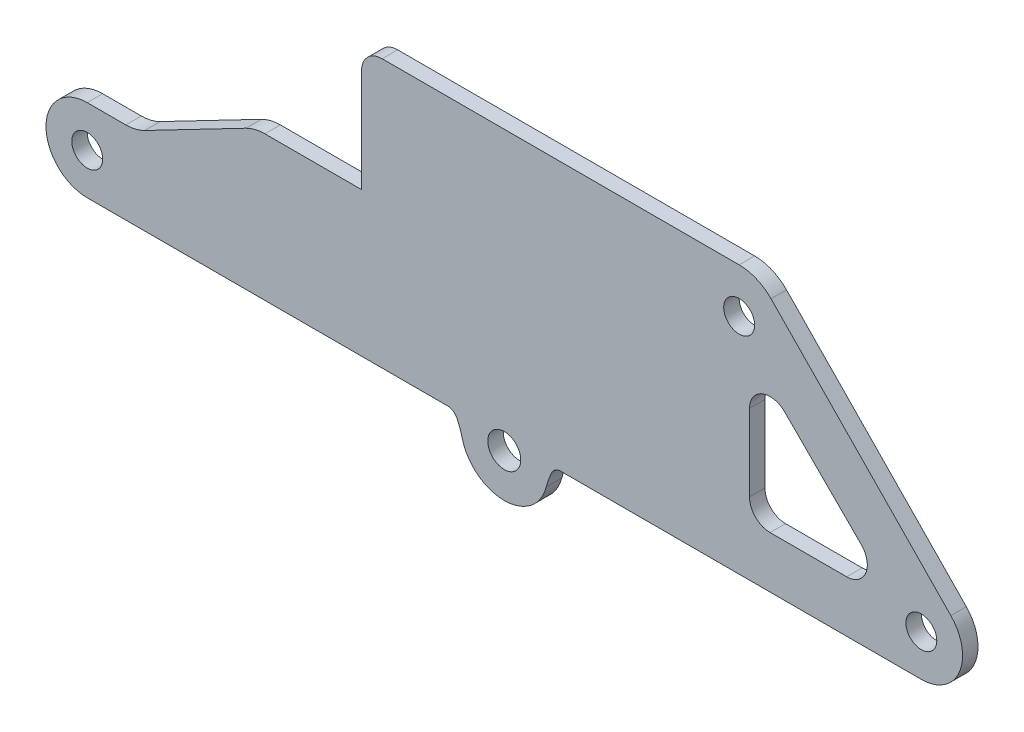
ISO-10303-21;
HEADER;
FILE_DESCRIPTION(('STEP AP214'),'2;1');
FILE_NAME('part.step','',(''),(''),'','','');
FILE_SCHEMA(('AUTOMOTIVE_DESIGN { 1 0 10303 214 1 1 1 1 }'));
ENDSEC;
DATA;
#1=APPLICATION_CONTEXT('core data for automotive mechanical design processes');
#2=APPLICATION_PROTOCOL_DEFINITION('international standard','automotive_design',2000,#1);
#3=PRODUCT_CONTEXT('',#1,'mechanical');
#4=PRODUCT('Part','Part','',(#3));
#5=PRODUCT_RELATED_PRODUCT_CATEGORY('part','',(#4));
#6=PRODUCT_DEFINITION_FORMATION('','',#4);
#7=PRODUCT_DEFINITION_CONTEXT('part definition',#1,'design');
#8=PRODUCT_DEFINITION('design','',#6,#7);
#9=PRODUCT_DEFINITION_SHAPE('','',#8);
#10=(LENGTH_UNIT() NAMED_UNIT(*) SI_UNIT(.MILLI.,.METRE.));
#11=(NAMED_UNIT(*) PLANE_ANGLE_UNIT() SI_UNIT($,.RADIAN.));
#12=(NAMED_UNIT(*) SI_UNIT($,.STERADIAN.) SOLID_ANGLE_UNIT());
#13=UNCERTAINTY_MEASURE_WITH_UNIT(LENGTH_MEASURE(1.E-05),#10,'distance_accuracy_value','');
#14=(GEOMETRIC_REPRESENTATION_CONTEXT(3) GLOBAL_UNCERTAINTY_ASSIGNED_CONTEXT((#13)) GLOBAL_UNIT_ASSIGNED_CONTEXT((#10,
#11,#12)) REPRESENTATION_CONTEXT('',''));
#15=CARTESIAN_POINT('',(0.,0.,0.));
#16=DIRECTION('',(0.,0.,1.));
#17=DIRECTION('',(1.,0.,0.));
#18=AXIS2_PLACEMENT_3D('',#15,#16,#17);
#19=CARTESIAN_POINT('',(17.,-13.,-1.5));
#20=DIRECTION('',(0.,-1.,0.));
#21=DIRECTION('',(1.,0.,0.));
#22=AXIS2_PLACEMENT_3D('',#19,#20,#21);
#23=PLANE('',#22);
#24=DIRECTION('',(1.,0.,0.));
#25=VECTOR('',#24,1.);
#26=CARTESIAN_POINT('',(17.,-13.,0.));
#27=LINE('',#26,#25);
#28=CARTESIAN_POINT('',(5.50214462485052,-13.,0.));
#29=VERTEX_POINT('',#28);
#30=CARTESIAN_POINT('',(40.4699111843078,-13.,1.56125112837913E-13));
#31=VERTEX_POINT('',#30);
#32=EDGE_CURVE('E268',#29,#31,#27,.T.);
#33=ORIENTED_EDGE('',*,*,#32,.F.);
#34=DIRECTION('',(0.,0.,1.));
#35=VECTOR('',#34,1.);
#36=CARTESIAN_POINT('',(5.50214462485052,-13.,-1.5));
#37=LINE('',#36,#35);
#38=CARTESIAN_POINT('',(5.50214462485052,-13.,-1.5));
#39=VERTEX_POINT('',#38);
#40=EDGE_CURVE('E444',#29,#39,#37,.F.);
#41=ORIENTED_EDGE('',*,*,#40,.T.);
#42=DIRECTION('',(1.,0.,0.));
#43=VECTOR('',#42,1.);
#44=CARTESIAN_POINT('',(17.,-13.,-1.5));
#45=LINE('',#44,#43);
#46=CARTESIAN_POINT('',(40.4699111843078,-13.,-1.49999999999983));
#47=VERTEX_POINT('',#46);
#48=EDGE_CURVE('E413',#39,#47,#45,.T.);
#49=ORIENTED_EDGE('',*,*,#48,.T.);
#50=DIRECTION('',(0.,0.,1.));
#51=VECTOR('',#50,1.);
#52=CARTESIAN_POINT('',(40.469911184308,-13.,-34.001));
#53=LINE('',#52,#51);
#54=EDGE_CURVE('E363',#47,#31,#53,.T.);
#55=ORIENTED_EDGE('',*,*,#54,.T.);
#56=EDGE_LOOP('',(#33,#41,#49,#55));
#57=FACE_BOUND('',#56,.T.);
#58=ADVANCED_FACE('F89',(#57),#23,.T.);
#59=CARTESIAN_POINT('',(0.,0.,-1.5));
#60=DIRECTION('',(0.,0.,1.));
#61=DIRECTION('',(1.,0.,0.));
#62=AXIS2_PLACEMENT_3D('',#59,#60,#61);
#63=PLANE('',#62);
#64=CARTESIAN_POINT('',(1.30451205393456E-12,-14.0000000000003,-1.5));
#65=DIRECTION('',(0.,0.,-1.));
#66=DIRECTION('',(-1.,0.,0.));
#67=AXIS2_PLACEMENT_3D('',#64,#65,#66);
#68=CIRCLE('',#67,1.6000000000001);
#69=CARTESIAN_POINT('',(-1.59999999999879,-14.0000000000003,-1.5));
#70=VERTEX_POINT('',#69);
#71=EDGE_CURVE('E368',#70,#70,#68,.T.);
#72=ORIENTED_EDGE('',*,*,#71,.F.);
#73=EDGE_LOOP('',(#72));
#74=FACE_BOUND('',#73,.T.);
#75=DIRECTION('',(0.,1.,0.));
#76=VECTOR('',#75,1.);
#77=CARTESIAN_POINT('',(-13.85,13.,-1.5));
#78=LINE('',#77,#76);
#79=CARTESIAN_POINT('',(-13.85,11.,-1.5));
#80=VERTEX_POINT('',#79);
#81=CARTESIAN_POINT('',(-13.85,1.00000000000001,-1.5));
#82=VERTEX_POINT('',#81);
#83=EDGE_CURVE('E405',#80,#82,#78,.F.);
#84=ORIENTED_EDGE('',*,*,#83,.F.);
#85=CARTESIAN_POINT('',(-11.85,11.,-1.5));
#86=DIRECTION('',(0.,0.,1.));
#87=DIRECTION('',(1.,0.,0.));
#88=AXIS2_PLACEMENT_3D('',#85,#86,#87);
#89=CIRCLE('',#88,2.);
#90=CARTESIAN_POINT('',(-11.85,13.,-1.5));
#91=VERTEX_POINT('',#90);
#92=EDGE_CURVE('E434',#80,#91,#89,.F.);
#93=ORIENTED_EDGE('',*,*,#92,.T.);
#94=DIRECTION('',(-1.,0.,0.));
#95=VECTOR('',#94,1.);
#96=CARTESIAN_POINT('',(17.,13.,-1.5));
#97=LINE('',#96,#95);
#98=CARTESIAN_POINT('',(22.7922416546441,13.,-1.49999999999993));
#99=VERTEX_POINT('',#98);
#100=EDGE_CURVE('E412',#99,#91,#97,.T.);
#101=ORIENTED_EDGE('',*,*,#100,.F.);
#102=CARTESIAN_POINT('',(22.7922416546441,8.67766952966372,-1.49999999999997));
#103=DIRECTION('',(0.,0.,-1.));
#104=DIRECTION('',(-1.,0.,0.));
#105=AXIS2_PLACEMENT_3D('',#102,#103,#104);
#106=CIRCLE('',#105,4.32233047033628);
#107=CARTESIAN_POINT('',(25.8877429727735,11.6943584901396,-1.49999999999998));
#108=VERTEX_POINT('',#107);
#109=EDGE_CURVE('E486',#99,#108,#106,.T.);
#110=ORIENTED_EDGE('',*,*,#109,.T.);
#111=DIRECTION('',(0.697931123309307,-0.716164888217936,0.));
#112=VECTOR('',#111,1.);
#113=CARTESIAN_POINT('',(43.3345707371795,-6.20827550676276,-1.49999999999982));
#114=LINE('',#113,#112);
#115=CARTESIAN_POINT('',(43.3345707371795,-6.20827550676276,-1.49999999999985));
#116=VERTEX_POINT('',#115);
#117=EDGE_CURVE('E478',#108,#116,#114,.T.);
#118=ORIENTED_EDGE('',*,*,#117,.T.);
#119=CARTESIAN_POINT('',(40.4699111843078,-8.99999999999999,-1.49999999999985));
#120=DIRECTION('',(0.,0.,-1.));
#121=DIRECTION('',(-1.,0.,0.));
#122=AXIS2_PLACEMENT_3D('',#119,#120,#121);
#123=CIRCLE('',#122,4.);
#124=EDGE_CURVE('E279',#116,#47,#123,.T.);
#125=ORIENTED_EDGE('',*,*,#124,.T.);
#126=ORIENTED_EDGE('',*,*,#48,.F.);
#127=CARTESIAN_POINT('',(5.50214462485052,-14.,-1.5));
#128=DIRECTION('',(0.,0.,1.));
#129=DIRECTION('',(1.,0.,0.));
#130=AXIS2_PLACEMENT_3D('',#127,#128,#129);
#131=CIRCLE('',#130,1.);
#132=CARTESIAN_POINT('',(4.59863672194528,-13.5714285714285,-1.5));
#133=VERTEX_POINT('',#132);
#134=EDGE_CURVE('E456',#39,#133,#131,.T.);
#135=ORIENTED_EDGE('',*,*,#134,.T.);
#136=CARTESIAN_POINT('',(11.8266999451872,-17.0000000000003,-1.5));
#137=DIRECTION('',(0.,0.,1.));
#138=DIRECTION('',(-1.,0.,0.));
#139=AXIS2_PLACEMENT_3D('',#136,#137,#138);
#140=CIRCLE('',#139,8.00000000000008);
#141=CARTESIAN_POINT('',(4.07228997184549,-15.0329906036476,-1.5));
#142=VERTEX_POINT('',#141);
#143=EDGE_CURVE('E384',#133,#142,#140,.T.);
#144=ORIENTED_EDGE('',*,*,#143,.T.);
#145=CARTESIAN_POINT('',(1.30451205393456E-12,-14.0000000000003,-1.5));
#146=DIRECTION('',(0.,0.,-1.));
#147=DIRECTION('',(-1.,0.,0.));
#148=AXIS2_PLACEMENT_3D('',#145,#146,#147);
#149=CIRCLE('',#148,4.20126352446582);
#150=CARTESIAN_POINT('',(-4.07228997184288,-15.0329906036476,-1.5));
#151=VERTEX_POINT('',#150);
#152=EDGE_CURVE('E375',#142,#151,#149,.T.);
#153=ORIENTED_EDGE('',*,*,#152,.T.);
#154=CARTESIAN_POINT('',(-11.8266999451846,-17.0000000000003,-1.5));
#155=DIRECTION('',(0.,0.,1.));
#156=DIRECTION('',(-1.,0.,0.));
#157=AXIS2_PLACEMENT_3D('',#154,#155,#156);
#158=CIRCLE('',#157,8.00000000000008);
#159=CARTESIAN_POINT('',(-4.59863672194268,-13.5714285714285,-1.5));
#160=VERTEX_POINT('',#159);
#161=EDGE_CURVE('E395',#151,#160,#158,.T.);
#162=ORIENTED_EDGE('',*,*,#161,.T.);
#163=CARTESIAN_POINT('',(-5.5021446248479,-14.,-1.5));
#164=DIRECTION('',(0.,0.,1.));
#165=DIRECTION('',(1.,0.,0.));
#166=AXIS2_PLACEMENT_3D('',#163,#164,#165);
#167=CIRCLE('',#166,1.);
#168=CARTESIAN_POINT('',(-5.5021446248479,-13.,-1.5));
#169=VERTEX_POINT('',#168);
#170=EDGE_CURVE('E450',#160,#169,#167,.T.);
#171=ORIENTED_EDGE('',*,*,#170,.T.);
#172=CARTESIAN_POINT('',(-40.4699111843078,-13.,-1.49999999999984));
#173=VERTEX_POINT('',#172);
#174=EDGE_CURVE('E408',#173,#169,#45,.T.);
#175=ORIENTED_EDGE('',*,*,#174,.F.);
#176=CARTESIAN_POINT('',(-40.4699111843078,-9.,-1.49999999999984));
#177=DIRECTION('',(0.,0.,-1.));
#178=DIRECTION('',(-1.,0.,0.));
#179=AXIS2_PLACEMENT_3D('',#176,#177,#178);
#180=CIRCLE('',#179,4.);
#181=CARTESIAN_POINT('',(-40.4699111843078,-4.99999999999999,-1.49999999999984));
#182=VERTEX_POINT('',#181);
#183=EDGE_CURVE('E330',#173,#182,#180,.T.);
#184=ORIENTED_EDGE('',*,*,#183,.T.);
#185=DIRECTION('',(-1.,0.,0.));
#186=VECTOR('',#185,1.);
#187=CARTESIAN_POINT('',(-14.4699111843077,-4.99999999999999,-1.50000000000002));
#188=LINE('',#187,#186);
#189=CARTESIAN_POINT('',(-36.730541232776,-4.99999999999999,-1.49999999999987));
#190=VERTEX_POINT('',#189);
#191=EDGE_CURVE('E352',#190,#182,#188,.T.);
#192=ORIENTED_EDGE('',*,*,#191,.F.);
#193=CARTESIAN_POINT('',(-36.730541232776,-0.999999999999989,-1.49999999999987));
#194=DIRECTION('',(0.,0.,-1.));
#195=DIRECTION('',(-1.,0.,0.));
#196=AXIS2_PLACEMENT_3D('',#193,#194,#195);
#197=CIRCLE('',#196,4.);
#198=CARTESIAN_POINT('',(-34.8863989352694,-4.54952661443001,-1.49999999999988));
#199=VERTEX_POINT('',#198);
#200=EDGE_CURVE('E327',#190,#199,#197,.F.);
#201=ORIENTED_EDGE('',*,*,#200,.T.);
#202=DIRECTION('',(-0.887381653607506,-0.46103557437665,0.));
#203=VECTOR('',#202,1.);
#204=CARTESIAN_POINT('',(-16.9482359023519,4.77017394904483,-1.5));
#205=LINE('',#204,#203);
#206=CARTESIAN_POINT('',(-25.0719582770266,0.549526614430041,-1.49999999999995));
#207=VERTEX_POINT('',#206);
#208=EDGE_CURVE('E344',#207,#199,#205,.T.);
#209=ORIENTED_EDGE('',*,*,#208,.F.);
#210=CARTESIAN_POINT('',(-23.22781597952,-2.99999999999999,-1.49999999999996));
#211=DIRECTION('',(0.,0.,-1.));
#212=DIRECTION('',(-1.,0.,0.));
#213=AXIS2_PLACEMENT_3D('',#210,#211,#212);
#214=CIRCLE('',#213,4.);
#215=CARTESIAN_POINT('',(-23.22781597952,1.00000000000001,-1.49999999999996));
#216=VERTEX_POINT('',#215);
#217=EDGE_CURVE('E333',#207,#216,#214,.T.);
#218=ORIENTED_EDGE('',*,*,#217,.T.);
#219=DIRECTION('',(-1.,0.,0.));
#220=VECTOR('',#219,1.);
#221=CARTESIAN_POINT('',(-15.7349555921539,1.00000000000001,-1.5));
#222=LINE('',#221,#220);
#223=EDGE_CURVE('E364',#216,#82,#222,.F.);
#224=ORIENTED_EDGE('',*,*,#223,.T.);
#225=EDGE_LOOP('',(#84,#93,#101,#110,#118,#125,#126,#135,#144,#153,#162,#171,#175,#184,#192,
#201,#209,#218,#224));
#226=FACE_BOUND('',#225,.T.);
#227=CARTESIAN_POINT('',(-40.4699111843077,-8.99999999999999,-1.49999999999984));
#228=DIRECTION('',(0.,0.,-1.));
#229=DIRECTION('',(-1.,0.,0.));
#230=AXIS2_PLACEMENT_3D('',#227,#228,#229);
#231=CIRCLE('',#230,1.5);
#232=CARTESIAN_POINT('',(-41.9699111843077,-8.99999999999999,-1.49999999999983));
#233=VERTEX_POINT('',#232);
#234=EDGE_CURVE('E359',#233,#233,#231,.T.);
#235=ORIENTED_EDGE('',*,*,#234,.F.);
#236=EDGE_LOOP('',(#235));
#237=FACE_BOUND('',#236,.T.);
#238=CARTESIAN_POINT('',(40.4699111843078,-8.99999999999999,-1.49999999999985));
#239=DIRECTION('',(0.,0.,-1.));
#240=DIRECTION('',(-1.,0.,0.));
#241=AXIS2_PLACEMENT_3D('',#238,#239,#240);
#242=CIRCLE('',#241,1.5);
#243=CARTESIAN_POINT('',(38.9699111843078,-8.99999999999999,-1.49999999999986));
#244=VERTEX_POINT('',#243);
#245=EDGE_CURVE('E517',#244,#244,#242,.F.);
#246=ORIENTED_EDGE('',*,*,#245,.T.);
#247=EDGE_LOOP('',(#246));
#248=FACE_BOUND('',#247,.T.);
#249=DIRECTION('',(-0.707106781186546,0.707106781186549,0.));
#250=VECTOR('',#249,1.);
#251=CARTESIAN_POINT('',(23.7922416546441,6.26345596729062,-1.49999999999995));
#252=LINE('',#251,#250);
#253=CARTESIAN_POINT('',(34.6414840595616,-4.5857864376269,-1.49999999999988));
#254=VERTEX_POINT('',#253);
#255=CARTESIAN_POINT('',(27.2064552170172,2.84924240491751,-1.49999999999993));
#256=VERTEX_POINT('',#255);
#257=EDGE_CURVE('E513',#254,#256,#252,.T.);
#258=ORIENTED_EDGE('',*,*,#257,.T.);
#259=CARTESIAN_POINT('',(25.7922416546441,1.43502884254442,-1.49999999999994));
#260=DIRECTION('',(0.,0.,-1.));
#261=DIRECTION('',(-1.,0.,0.));
#262=AXIS2_PLACEMENT_3D('',#259,#260,#261);
#263=CIRCLE('',#262,2.);
#264=CARTESIAN_POINT('',(23.7922416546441,1.43502884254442,-1.49999999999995));
#265=VERTEX_POINT('',#264);
#266=EDGE_CURVE('E510',#256,#265,#263,.F.);
#267=ORIENTED_EDGE('',*,*,#266,.T.);
#268=DIRECTION('',(0.,-1.,0.));
#269=VECTOR('',#268,1.);
#270=CARTESIAN_POINT('',(23.7922416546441,6.26345596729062,-1.49999999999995));
#271=LINE('',#270,#269);
#272=CARTESIAN_POINT('',(23.7922416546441,-5.99999999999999,-1.49999999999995));
#273=VERTEX_POINT('',#272);
#274=EDGE_CURVE('E506',#265,#273,#271,.T.);
#275=ORIENTED_EDGE('',*,*,#274,.T.);
#276=CARTESIAN_POINT('',(25.7922416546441,-5.99999999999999,-1.49999999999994));
#277=DIRECTION('',(0.,0.,-1.));
#278=DIRECTION('',(-1.,0.,0.));
#279=AXIS2_PLACEMENT_3D('',#276,#277,#278);
#280=CIRCLE('',#279,2.);
#281=CARTESIAN_POINT('',(25.7922416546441,-7.99999999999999,-1.49999999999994));
#282=VERTEX_POINT('',#281);
#283=EDGE_CURVE('E503',#273,#282,#280,.F.);
#284=ORIENTED_EDGE('',*,*,#283,.T.);
#285=DIRECTION('',(1.,0.,0.));
#286=VECTOR('',#285,1.);
#287=CARTESIAN_POINT('',(23.7922416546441,-7.99999999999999,-1.49999999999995));
#288=LINE('',#287,#286);
#289=CARTESIAN_POINT('',(33.2272704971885,-7.99999999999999,-1.49999999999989));
#290=VERTEX_POINT('',#289);
#291=EDGE_CURVE('E499',#282,#290,#288,.T.);
#292=ORIENTED_EDGE('',*,*,#291,.T.);
#293=CARTESIAN_POINT('',(33.2272704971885,-5.99999999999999,-1.49999999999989));
#294=DIRECTION('',(0.,0.,-1.));
#295=DIRECTION('',(-1.,0.,0.));
#296=AXIS2_PLACEMENT_3D('',#293,#294,#295);
#297=CIRCLE('',#296,2.);
#298=EDGE_CURVE('E496',#290,#254,#297,.F.);
#299=ORIENTED_EDGE('',*,*,#298,.T.);
#300=EDGE_LOOP('',(#258,#267,#275,#284,#292,#299));
#301=FACE_BOUND('',#300,.T.);
#302=CARTESIAN_POINT('',(22.7922416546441,8.67766952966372,-1.49999999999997));
#303=DIRECTION('',(0.,0.,-1.));
#304=DIRECTION('',(-1.,0.,0.));
#305=AXIS2_PLACEMENT_3D('',#302,#303,#304);
#306=CIRCLE('',#305,1.5);
#307=CARTESIAN_POINT('',(21.2922416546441,8.67766952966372,-1.49999999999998));
#308=VERTEX_POINT('',#307);
#309=EDGE_CURVE('E492',#308,#308,#306,.F.);
#310=ORIENTED_EDGE('',*,*,#309,.T.);
#311=EDGE_LOOP('',(#310));
#312=FACE_BOUND('',#311,.T.);
#313=ADVANCED_FACE('F475',(#74,#226,#237,#248,#301,#312),#63,.F.);
#314=CARTESIAN_POINT('',(0.,0.,0.));
#315=DIRECTION('',(0.,0.,1.));
#316=DIRECTION('',(1.,0.,0.));
#317=AXIS2_PLACEMENT_3D('',#314,#315,#316);
#318=PLANE('',#317);
#319=CARTESIAN_POINT('',(1.30451205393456E-12,-14.0000000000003,0.));
#320=DIRECTION('',(0.,0.,-1.));
#321=DIRECTION('',(-1.,0.,0.));
#322=AXIS2_PLACEMENT_3D('',#319,#320,#321);
#323=CIRCLE('',#322,1.6000000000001);
#324=CARTESIAN_POINT('',(-1.59999999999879,-14.0000000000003,0.));
#325=VERTEX_POINT('',#324);
#326=EDGE_CURVE('E371',#325,#325,#323,.T.);
#327=ORIENTED_EDGE('',*,*,#326,.T.);
#328=EDGE_LOOP('',(#327));
#329=FACE_BOUND('',#328,.T.);
#330=DIRECTION('',(-1.,0.,0.));
#331=VECTOR('',#330,1.);
#332=CARTESIAN_POINT('',(17.,13.,0.));
#333=LINE('',#332,#331);
#334=CARTESIAN_POINT('',(22.7922416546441,13.,0.));
#335=VERTEX_POINT('',#334);
#336=CARTESIAN_POINT('',(-11.85,13.,0.));
#337=VERTEX_POINT('',#336);
#338=EDGE_CURVE('E422',#335,#337,#333,.T.);
#339=ORIENTED_EDGE('',*,*,#338,.T.);
#340=CARTESIAN_POINT('',(-11.85,11.,0.));
#341=DIRECTION('',(0.,0.,1.));
#342=DIRECTION('',(1.,0.,0.));
#343=AXIS2_PLACEMENT_3D('',#340,#341,#342);
#344=CIRCLE('',#343,2.);
#345=CARTESIAN_POINT('',(-13.85,11.,0.));
#346=VERTEX_POINT('',#345);
#347=EDGE_CURVE('E428',#337,#346,#344,.T.);
#348=ORIENTED_EDGE('',*,*,#347,.T.);
#349=DIRECTION('',(0.,1.,0.));
#350=VECTOR('',#349,1.);
#351=CARTESIAN_POINT('',(-13.85,13.,0.));
#352=LINE('',#351,#350);
#353=CARTESIAN_POINT('',(-13.85,1.00000000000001,0.));
#354=VERTEX_POINT('',#353);
#355=EDGE_CURVE('E93',#346,#354,#352,.F.);
#356=ORIENTED_EDGE('',*,*,#355,.T.);
#357=DIRECTION('',(-1.,0.,0.));
#358=VECTOR('',#357,1.);
#359=CARTESIAN_POINT('',(-15.7349555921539,1.00000000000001,0.));
#360=LINE('',#359,#358);
#361=CARTESIAN_POINT('',(-23.22781597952,1.00000000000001,0.));
#362=VERTEX_POINT('',#361);
#363=EDGE_CURVE('E107',#362,#354,#360,.F.);
#364=ORIENTED_EDGE('',*,*,#363,.F.);
#365=CARTESIAN_POINT('',(-23.22781597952,-2.99999999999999,0.));
#366=DIRECTION('',(0.,0.,-1.));
#367=DIRECTION('',(-1.,0.,0.));
#368=AXIS2_PLACEMENT_3D('',#365,#366,#367);
#369=CIRCLE('',#368,4.);
#370=CARTESIAN_POINT('',(-25.0719582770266,0.54952661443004,0.));
#371=VERTEX_POINT('',#370);
#372=EDGE_CURVE('E320',#362,#371,#369,.F.);
#373=ORIENTED_EDGE('',*,*,#372,.T.);
#374=DIRECTION('',(-0.887381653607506,-0.46103557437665,0.));
#375=VECTOR('',#374,1.);
#376=CARTESIAN_POINT('',(-16.9482359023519,4.77017394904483,0.));
#377=LINE('',#376,#375);
#378=CARTESIAN_POINT('',(-34.8863989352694,-4.54952661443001,1.17961196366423E-13));
#379=VERTEX_POINT('',#378);
#380=EDGE_CURVE('E316',#371,#379,#377,.T.);
#381=ORIENTED_EDGE('',*,*,#380,.T.);
#382=CARTESIAN_POINT('',(-36.730541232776,-0.999999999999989,1.31838984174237E-13));
#383=DIRECTION('',(0.,0.,-1.));
#384=DIRECTION('',(-1.,0.,0.));
#385=AXIS2_PLACEMENT_3D('',#382,#383,#384);
#386=CIRCLE('',#385,4.);
#387=CARTESIAN_POINT('',(-36.730541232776,-4.99999999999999,1.31838984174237E-13));
#388=VERTEX_POINT('',#387);
#389=EDGE_CURVE('E313',#379,#388,#386,.T.);
#390=ORIENTED_EDGE('',*,*,#389,.T.);
#391=DIRECTION('',(-1.,0.,0.));
#392=VECTOR('',#391,1.);
#393=CARTESIAN_POINT('',(-14.4699111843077,-4.99999999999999,0.));
#394=LINE('',#393,#392);
#395=CARTESIAN_POINT('',(-40.4699111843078,-4.99999999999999,1.56125112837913E-13));
#396=VERTEX_POINT('',#395);
#397=EDGE_CURVE('E309',#388,#396,#394,.T.);
#398=ORIENTED_EDGE('',*,*,#397,.T.);
#399=CARTESIAN_POINT('',(-40.4699111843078,-8.99999999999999,1.56125112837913E-13));
#400=DIRECTION('',(0.,0.,-1.));
#401=DIRECTION('',(-1.,0.,0.));
#402=AXIS2_PLACEMENT_3D('',#399,#400,#401);
#403=CIRCLE('',#402,4.);
#404=CARTESIAN_POINT('',(-40.4699111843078,-13.,1.56125112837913E-13));
#405=VERTEX_POINT('',#404);
#406=EDGE_CURVE('E305',#396,#405,#403,.F.);
#407=ORIENTED_EDGE('',*,*,#406,.T.);
#408=CARTESIAN_POINT('',(-5.5021446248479,-13.,0.));
#409=VERTEX_POINT('',#408);
#410=EDGE_CURVE('E418',#405,#409,#27,.T.);
#411=ORIENTED_EDGE('',*,*,#410,.T.);
#412=CARTESIAN_POINT('',(-5.5021446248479,-14.,0.));
#413=DIRECTION('',(0.,0.,1.));
#414=DIRECTION('',(1.,0.,0.));
#415=AXIS2_PLACEMENT_3D('',#412,#413,#414);
#416=CIRCLE('',#415,1.);
#417=CARTESIAN_POINT('',(-4.59863672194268,-13.5714285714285,0.));
#418=VERTEX_POINT('',#417);
#419=EDGE_CURVE('E453',#409,#418,#416,.F.);
#420=ORIENTED_EDGE('',*,*,#419,.T.);
#421=CARTESIAN_POINT('',(-11.8266999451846,-17.0000000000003,0.));
#422=DIRECTION('',(0.,0.,1.));
#423=DIRECTION('',(-1.,0.,0.));
#424=AXIS2_PLACEMENT_3D('',#421,#422,#423);
#425=CIRCLE('',#424,8.00000000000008);
#426=CARTESIAN_POINT('',(-4.07228997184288,-15.0329906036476,0.));
#427=VERTEX_POINT('',#426);
#428=EDGE_CURVE('E383',#427,#418,#425,.T.);
#429=ORIENTED_EDGE('',*,*,#428,.F.);
#430=CARTESIAN_POINT('',(1.30451205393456E-12,-14.0000000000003,0.));
#431=DIRECTION('',(0.,0.,-1.));
#432=DIRECTION('',(-1.,0.,0.));
#433=AXIS2_PLACEMENT_3D('',#430,#431,#432);
#434=CIRCLE('',#433,4.20126352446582);
#435=CARTESIAN_POINT('',(4.07228997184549,-15.0329906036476,0.));
#436=VERTEX_POINT('',#435);
#437=EDGE_CURVE('E379',#436,#427,#434,.T.);
#438=ORIENTED_EDGE('',*,*,#437,.F.);
#439=CARTESIAN_POINT('',(11.8266999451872,-17.0000000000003,0.));
#440=DIRECTION('',(0.,0.,1.));
#441=DIRECTION('',(-1.,0.,0.));
#442=AXIS2_PLACEMENT_3D('',#439,#440,#441);
#443=CIRCLE('',#442,8.00000000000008);
#444=CARTESIAN_POINT('',(4.59863672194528,-13.5714285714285,0.));
#445=VERTEX_POINT('',#444);
#446=EDGE_CURVE('E388',#445,#436,#443,.T.);
#447=ORIENTED_EDGE('',*,*,#446,.F.);
#448=CARTESIAN_POINT('',(5.50214462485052,-14.,0.));
#449=DIRECTION('',(0.,0.,1.));
#450=DIRECTION('',(1.,0.,0.));
#451=AXIS2_PLACEMENT_3D('',#448,#449,#450);
#452=CIRCLE('',#451,1.);
#453=EDGE_CURVE('E99',#445,#29,#452,.F.);
#454=ORIENTED_EDGE('',*,*,#453,.T.);
#455=ORIENTED_EDGE('',*,*,#32,.T.);
#456=CARTESIAN_POINT('',(40.4699111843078,-8.99999999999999,1.56125112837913E-13));
#457=DIRECTION('',(0.,0.,-1.));
#458=DIRECTION('',(1.,0.,0.));
#459=AXIS2_PLACEMENT_3D('',#456,#457,#458);
#460=CIRCLE('',#459,4.);
#461=CARTESIAN_POINT('',(43.3345707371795,-6.20827550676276,1.76941794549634E-13));
#462=VERTEX_POINT('',#461);
#463=EDGE_CURVE('E260',#462,#31,#460,.T.);
#464=ORIENTED_EDGE('',*,*,#463,.F.);
#465=DIRECTION('',(0.697931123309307,-0.716164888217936,0.));
#466=VECTOR('',#465,1.);
#467=CARTESIAN_POINT('',(43.3345707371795,-6.20827550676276,1.76941794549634E-13));
#468=LINE('',#467,#466);
#469=CARTESIAN_POINT('',(25.8877429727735,11.6943584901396,0.));
#470=VERTEX_POINT('',#469);
#471=EDGE_CURVE('E266',#470,#462,#468,.T.);
#472=ORIENTED_EDGE('',*,*,#471,.F.);
#473=CARTESIAN_POINT('',(22.7922416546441,8.67766952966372,0.));
#474=DIRECTION('',(0.,0.,-1.));
#475=DIRECTION('',(1.,0.,0.));
#476=AXIS2_PLACEMENT_3D('',#473,#474,#475);
#477=CIRCLE('',#476,4.32233047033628);
#478=EDGE_CURVE('E293',#335,#470,#477,.T.);
#479=ORIENTED_EDGE('',*,*,#478,.F.);
#480=EDGE_LOOP('',(#339,#348,#356,#364,#373,#381,#390,#398,#407,#411,#420,#429,#438,#447,#454,
#455,#464,#472,#479));
#481=FACE_BOUND('',#480,.T.);
#482=CARTESIAN_POINT('',(-40.4699111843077,-8.99999999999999,1.56125112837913E-13));
#483=DIRECTION('',(0.,0.,-1.));
#484=DIRECTION('',(1.,0.,0.));
#485=AXIS2_PLACEMENT_3D('',#482,#483,#484);
#486=CIRCLE('',#485,1.5);
#487=CARTESIAN_POINT('',(-41.9699111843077,-8.99999999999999,1.66657806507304E-13));
#488=VERTEX_POINT('',#487);
#489=EDGE_CURVE('E301',#488,#488,#486,.T.);
#490=ORIENTED_EDGE('',*,*,#489,.T.);
#491=EDGE_LOOP('',(#490));
#492=FACE_BOUND('',#491,.T.);
#493=CARTESIAN_POINT('',(22.7922416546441,8.67766952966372,0.));
#494=DIRECTION('',(0.,0.,1.));
#495=DIRECTION('',(1.,0.,0.));
#496=AXIS2_PLACEMENT_3D('',#493,#494,#495);
#497=CIRCLE('',#496,1.5);
#498=CARTESIAN_POINT('',(24.2922416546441,8.67766952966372,0.));
#499=VERTEX_POINT('',#498);
#500=EDGE_CURVE('E558',#499,#499,#497,.T.);
#501=ORIENTED_EDGE('',*,*,#500,.F.);
#502=EDGE_LOOP('',(#501));
#503=FACE_BOUND('',#502,.T.);
#504=DIRECTION('',(1.,0.,0.));
#505=VECTOR('',#504,1.);
#506=CARTESIAN_POINT('',(23.7922416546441,-7.99999999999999,0.));
#507=LINE('',#506,#505);
#508=CARTESIAN_POINT('',(25.7922416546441,-7.99999999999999,0.));
#509=VERTEX_POINT('',#508);
#510=CARTESIAN_POINT('',(33.2272704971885,-7.99999999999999,1.07552855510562E-13));
#511=VERTEX_POINT('',#510);
#512=EDGE_CURVE('E550',#509,#511,#507,.T.);
#513=ORIENTED_EDGE('',*,*,#512,.F.);
#514=CARTESIAN_POINT('',(25.7922416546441,-5.99999999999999,0.));
#515=DIRECTION('',(0.,0.,-1.));
#516=DIRECTION('',(-1.,0.,0.));
#517=AXIS2_PLACEMENT_3D('',#514,#515,#516);
#518=CIRCLE('',#517,2.);
#519=CARTESIAN_POINT('',(23.7922416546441,-5.99999999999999,0.));
#520=VERTEX_POINT('',#519);
#521=EDGE_CURVE('E480',#509,#520,#518,.T.);
#522=ORIENTED_EDGE('',*,*,#521,.T.);
#523=DIRECTION('',(0.,-1.,0.));
#524=VECTOR('',#523,1.);
#525=CARTESIAN_POINT('',(23.7922416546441,6.26345596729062,0.));
#526=LINE('',#525,#524);
#527=CARTESIAN_POINT('',(23.7922416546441,1.43502884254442,0.));
#528=VERTEX_POINT('',#527);
#529=EDGE_CURVE('E543',#528,#520,#526,.T.);
#530=ORIENTED_EDGE('',*,*,#529,.F.);
#531=CARTESIAN_POINT('',(25.7922416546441,1.43502884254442,0.));
#532=DIRECTION('',(0.,0.,-1.));
#533=DIRECTION('',(-1.,0.,0.));
#534=AXIS2_PLACEMENT_3D('',#531,#532,#533);
#535=CIRCLE('',#534,2.);
#536=CARTESIAN_POINT('',(27.2064552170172,2.84924240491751,0.));
#537=VERTEX_POINT('',#536);
#538=EDGE_CURVE('E484',#528,#537,#535,.T.);
#539=ORIENTED_EDGE('',*,*,#538,.T.);
#540=DIRECTION('',(-0.707106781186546,0.707106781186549,0.));
#541=VECTOR('',#540,1.);
#542=CARTESIAN_POINT('',(23.7922416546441,6.26345596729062,0.));
#543=LINE('',#542,#541);
#544=CARTESIAN_POINT('',(34.6414840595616,-4.5857864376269,1.14491749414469E-13));
#545=VERTEX_POINT('',#544);
#546=EDGE_CURVE('E528',#545,#537,#543,.T.);
#547=ORIENTED_EDGE('',*,*,#546,.F.);
#548=CARTESIAN_POINT('',(33.2272704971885,-5.99999999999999,1.07552855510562E-13));
#549=DIRECTION('',(0.,0.,-1.));
#550=DIRECTION('',(-1.,0.,0.));
#551=AXIS2_PLACEMENT_3D('',#548,#549,#550);
#552=CIRCLE('',#551,2.);
#553=EDGE_CURVE('E473',#545,#511,#552,.T.);
#554=ORIENTED_EDGE('',*,*,#553,.T.);
#555=EDGE_LOOP('',(#513,#522,#530,#539,#547,#554));
#556=FACE_BOUND('',#555,.T.);
#557=CARTESIAN_POINT('',(40.4699111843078,-8.99999999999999,1.56125112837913E-13));
#558=DIRECTION('',(0.,0.,1.));
#559=DIRECTION('',(1.,0.,0.));
#560=AXIS2_PLACEMENT_3D('',#557,#558,#559);
#561=CIRCLE('',#560,1.5);
#562=CARTESIAN_POINT('',(41.9699111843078,-8.99999999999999,1.66657806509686E-13));
#563=VERTEX_POINT('',#562);
#564=EDGE_CURVE('E521',#563,#563,#561,.T.);
#565=ORIENTED_EDGE('',*,*,#564,.F.);
#566=EDGE_LOOP('',(#565));
#567=FACE_BOUND('',#566,.T.);
#568=ADVANCED_FACE('F91',(#329,#481,#492,#503,#556,#567),#318,.T.);
#569=CARTESIAN_POINT('',(17.,13.,-1.5));
#570=DIRECTION('',(0.,1.,0.));
#571=DIRECTION('',(-1.,0.,0.));
#572=AXIS2_PLACEMENT_3D('',#569,#570,#571);
#573=PLANE('',#572);
#574=ORIENTED_EDGE('',*,*,#100,.T.);
#575=DIRECTION('',(0.,0.,-1.));
#576=VECTOR('',#575,1.);
#577=CARTESIAN_POINT('',(-11.85,13.,-1.5));
#578=LINE('',#577,#576);
#579=EDGE_CURVE('E417',#91,#337,#578,.F.);
#580=ORIENTED_EDGE('',*,*,#579,.T.);
#581=ORIENTED_EDGE('',*,*,#338,.F.);
#582=DIRECTION('',(0.,0.,1.));
#583=VECTOR('',#582,1.);
#584=CARTESIAN_POINT('',(22.7922416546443,13.,-34.0010000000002));
#585=LINE('',#584,#583);
#586=EDGE_CURVE('E288',#99,#335,#585,.T.);
#587=ORIENTED_EDGE('',*,*,#586,.F.);
#588=EDGE_LOOP('',(#574,#580,#581,#587));
#589=FACE_BOUND('',#588,.T.);
#590=ADVANCED_FACE('F567',(#589),#573,.T.);
#591=ORIENTED_EDGE('',*,*,#174,.T.);
#592=DIRECTION('',(0.,0.,1.));
#593=VECTOR('',#592,1.);
#594=CARTESIAN_POINT('',(-5.5021446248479,-13.,0.));
#595=LINE('',#594,#593);
#596=EDGE_CURVE('E441',#169,#409,#595,.T.);
#597=ORIENTED_EDGE('',*,*,#596,.T.);
#598=ORIENTED_EDGE('',*,*,#410,.F.);
#599=DIRECTION('',(0.,0.,-1.));
#600=VECTOR('',#599,1.);
#601=CARTESIAN_POINT('',(-40.4699111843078,-13.,1.59594559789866E-13));
#602=LINE('',#601,#600);
#603=EDGE_CURVE('E323',#405,#173,#602,.T.);
#604=ORIENTED_EDGE('',*,*,#603,.T.);
#605=EDGE_LOOP('',(#591,#597,#598,#604));
#606=FACE_BOUND('',#605,.T.);
#607=ADVANCED_FACE('F630',(#606),#23,.T.);
#608=CARTESIAN_POINT('',(-13.85,7.,-1.5));
#609=DIRECTION('',(1.,0.,0.));
#610=DIRECTION('',(0.,1.,0.));
#611=AXIS2_PLACEMENT_3D('',#608,#609,#610);
#612=PLANE('',#611);
#613=ORIENTED_EDGE('',*,*,#355,.F.);
#614=DIRECTION('',(0.,0.,1.));
#615=VECTOR('',#614,1.);
#616=CARTESIAN_POINT('',(-13.85,11.,-1.5));
#617=LINE('',#616,#615);
#618=EDGE_CURVE('E431',#346,#80,#617,.F.);
#619=ORIENTED_EDGE('',*,*,#618,.T.);
#620=ORIENTED_EDGE('',*,*,#83,.T.);
#621=DIRECTION('',(0.,0.,1.));
#622=VECTOR('',#621,1.);
#623=CARTESIAN_POINT('',(-13.85,1.00000000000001,-1.5));
#624=LINE('',#623,#622);
#625=EDGE_CURVE('E13',#82,#354,#624,.T.);
#626=ORIENTED_EDGE('',*,*,#625,.T.);
#627=EDGE_LOOP('',(#613,#619,#620,#626));
#628=FACE_BOUND('',#627,.T.);
#629=ADVANCED_FACE('F573',(#628),#612,.F.);
#630=CARTESIAN_POINT('',(-11.85,11.,-1.5));
#631=DIRECTION('',(0.,0.,-1.));
#632=DIRECTION('',(-1.,0.,0.));
#633=AXIS2_PLACEMENT_3D('',#630,#631,#632);
#634=CYLINDRICAL_SURFACE('',#633,2.);
#635=ORIENTED_EDGE('',*,*,#92,.F.);
#636=ORIENTED_EDGE('',*,*,#618,.F.);
#637=ORIENTED_EDGE('',*,*,#347,.F.);
#638=ORIENTED_EDGE('',*,*,#579,.F.);
#639=EDGE_LOOP('',(#635,#636,#637,#638));
#640=FACE_BOUND('',#639,.T.);
#641=ADVANCED_FACE('F571',(#640),#634,.T.);
#642=CARTESIAN_POINT('',(1.30451205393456E-12,-14.0000000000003,0.));
#643=DIRECTION('',(0.,0.,-1.));
#644=DIRECTION('',(-1.,0.,0.));
#645=AXIS2_PLACEMENT_3D('',#642,#643,#644);
#646=CYLINDRICAL_SURFACE('',#645,4.20126352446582);
#647=ORIENTED_EDGE('',*,*,#152,.F.);
#648=DIRECTION('',(0.,0.,-1.));
#649=VECTOR('',#648,1.);
#650=CARTESIAN_POINT('',(4.07228997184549,-15.0329906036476,0.));
#651=LINE('',#650,#649);
#652=EDGE_CURVE('E401',#436,#142,#651,.T.);
#653=ORIENTED_EDGE('',*,*,#652,.F.);
#654=ORIENTED_EDGE('',*,*,#437,.T.);
#655=DIRECTION('',(0.,0.,-1.));
#656=VECTOR('',#655,1.);
#657=CARTESIAN_POINT('',(-4.07228997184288,-15.0329906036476,0.));
#658=LINE('',#657,#656);
#659=EDGE_CURVE('E391',#427,#151,#658,.T.);
#660=ORIENTED_EDGE('',*,*,#659,.T.);
#661=EDGE_LOOP('',(#647,#653,#654,#660));
#662=FACE_BOUND('',#661,.T.);
#663=ADVANCED_FACE('F612',(#662),#646,.T.);
#664=CARTESIAN_POINT('',(11.8266999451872,-17.0000000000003,0.));
#665=DIRECTION('',(0.,0.,-1.));
#666=DIRECTION('',(-1.,0.,0.));
#667=AXIS2_PLACEMENT_3D('',#664,#665,#666);
#668=CYLINDRICAL_SURFACE('',#667,8.00000000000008);
#669=ORIENTED_EDGE('',*,*,#143,.F.);
#670=DIRECTION('',(0.,0.,-1.));
#671=VECTOR('',#670,1.);
#672=CARTESIAN_POINT('',(4.59863672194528,-13.5714285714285,0.));
#673=LINE('',#672,#671);
#674=EDGE_CURVE('E115',#133,#445,#673,.F.);
#675=ORIENTED_EDGE('',*,*,#674,.T.);
#676=ORIENTED_EDGE('',*,*,#446,.T.);
#677=ORIENTED_EDGE('',*,*,#652,.T.);
#678=EDGE_LOOP('',(#669,#675,#676,#677));
#679=FACE_BOUND('',#678,.T.);
#680=ADVANCED_FACE('F617',(#679),#668,.F.);
#681=CARTESIAN_POINT('',(-11.8266999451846,-17.0000000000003,0.));
#682=DIRECTION('',(0.,0.,-1.));
#683=DIRECTION('',(-1.,0.,0.));
#684=AXIS2_PLACEMENT_3D('',#681,#682,#683);
#685=CYLINDRICAL_SURFACE('',#684,8.00000000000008);
#686=ORIENTED_EDGE('',*,*,#428,.T.);
#687=DIRECTION('',(0.,0.,-1.));
#688=VECTOR('',#687,1.);
#689=CARTESIAN_POINT('',(-4.59863672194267,-13.5714285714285,0.));
#690=LINE('',#689,#688);
#691=EDGE_CURVE('E437',#418,#160,#690,.T.);
#692=ORIENTED_EDGE('',*,*,#691,.T.);
#693=ORIENTED_EDGE('',*,*,#161,.F.);
#694=ORIENTED_EDGE('',*,*,#659,.F.);
#695=EDGE_LOOP('',(#686,#692,#693,#694));
#696=FACE_BOUND('',#695,.T.);
#697=ADVANCED_FACE('F608',(#696),#685,.F.);
#698=CARTESIAN_POINT('',(1.30451205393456E-12,-14.0000000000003,0.));
#699=DIRECTION('',(0.,0.,-1.));
#700=DIRECTION('',(-1.,0.,0.));
#701=AXIS2_PLACEMENT_3D('',#698,#699,#700);
#702=CYLINDRICAL_SURFACE('',#701,1.6000000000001);
#703=ORIENTED_EDGE('',*,*,#326,.F.);
#704=EDGE_LOOP('',(#703));
#705=FACE_BOUND('',#704,.T.);
#706=ORIENTED_EDGE('',*,*,#71,.T.);
#707=EDGE_LOOP('',(#706));
#708=FACE_BOUND('',#707,.T.);
#709=ADVANCED_FACE('F624',(#705,#708),#702,.F.);
#710=CARTESIAN_POINT('',(-5.5021446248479,-14.,0.));
#711=DIRECTION('',(0.,0.,-1.));
#712=DIRECTION('',(-1.,0.,0.));
#713=AXIS2_PLACEMENT_3D('',#710,#711,#712);
#714=CYLINDRICAL_SURFACE('',#713,1.);
#715=ORIENTED_EDGE('',*,*,#419,.F.);
#716=ORIENTED_EDGE('',*,*,#596,.F.);
#717=ORIENTED_EDGE('',*,*,#170,.F.);
#718=ORIENTED_EDGE('',*,*,#691,.F.);
#719=EDGE_LOOP('',(#715,#716,#717,#718));
#720=FACE_BOUND('',#719,.T.);
#721=ADVANCED_FACE('F605',(#720),#714,.F.);
#722=CARTESIAN_POINT('',(5.50214462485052,-14.,0.));
#723=DIRECTION('',(0.,0.,-1.));
#724=DIRECTION('',(-1.,0.,0.));
#725=AXIS2_PLACEMENT_3D('',#722,#723,#724);
#726=CYLINDRICAL_SURFACE('',#725,1.);
#727=ORIENTED_EDGE('',*,*,#453,.F.);
#728=ORIENTED_EDGE('',*,*,#674,.F.);
#729=ORIENTED_EDGE('',*,*,#134,.F.);
#730=ORIENTED_EDGE('',*,*,#40,.F.);
#731=EDGE_LOOP('',(#727,#728,#729,#730));
#732=FACE_BOUND('',#731,.T.);
#733=ADVANCED_FACE('F616',(#732),#726,.F.);
#734=CARTESIAN_POINT('',(-15.7349555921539,1.00000000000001,-0.750000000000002));
#735=DIRECTION('',(0.,-1.,0.));
#736=DIRECTION('',(-1.,0.,0.));
#737=AXIS2_PLACEMENT_3D('',#734,#735,#736);
#738=PLANE('',#737);
#739=ORIENTED_EDGE('',*,*,#363,.T.);
#740=ORIENTED_EDGE('',*,*,#625,.F.);
#741=ORIENTED_EDGE('',*,*,#223,.F.);
#742=DIRECTION('',(0.,0.,-1.));
#743=VECTOR('',#742,1.);
#744=CARTESIAN_POINT('',(-23.22781597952,1.00000000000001,-1.49999999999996));
#745=LINE('',#744,#743);
#746=EDGE_CURVE('E298',#216,#362,#745,.F.);
#747=ORIENTED_EDGE('',*,*,#746,.T.);
#748=EDGE_LOOP('',(#739,#740,#741,#747));
#749=FACE_BOUND('',#748,.T.);
#750=ADVANCED_FACE('F577',(#749),#738,.F.);
#751=CARTESIAN_POINT('',(-40.4699111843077,-8.99999999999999,1.56125112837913E-13));
#752=DIRECTION('',(0.,0.,-1.));
#753=DIRECTION('',(-1.,0.,0.));
#754=AXIS2_PLACEMENT_3D('',#751,#752,#753);
#755=CYLINDRICAL_SURFACE('',#754,1.5);
#756=CARTESIAN_POINT('',(-41.9699111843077,-8.99999999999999,1.66657806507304E-13));
#757=CARTESIAN_POINT('',(-41.9699111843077,-8.99999999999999,-0.0156249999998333));
#758=CARTESIAN_POINT('',(-41.9699111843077,-8.99999999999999,-0.0312499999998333));
#759=CARTESIAN_POINT('',(-41.9699111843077,-8.99999999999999,-0.0624999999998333));
#760=CARTESIAN_POINT('',(-41.9699111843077,-8.99999999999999,-0.0781249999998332));
#761=CARTESIAN_POINT('',(-41.9699111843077,-8.99999999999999,-0.109374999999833));
#762=CARTESIAN_POINT('',(-41.9699111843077,-8.99999999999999,-0.124999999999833));
#763=CARTESIAN_POINT('',(-41.9699111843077,-8.99999999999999,-0.156249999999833));
#764=CARTESIAN_POINT('',(-41.9699111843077,-8.99999999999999,-0.171874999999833));
#765=CARTESIAN_POINT('',(-41.9699111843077,-8.99999999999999,-0.203124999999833));
#766=CARTESIAN_POINT('',(-41.9699111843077,-8.99999999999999,-0.218749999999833));
#767=CARTESIAN_POINT('',(-41.9699111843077,-8.99999999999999,-0.249999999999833));
#768=CARTESIAN_POINT('',(-41.9699111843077,-8.99999999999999,-0.265624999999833));
#769=CARTESIAN_POINT('',(-41.9699111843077,-8.99999999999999,-0.296874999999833));
#770=CARTESIAN_POINT('',(-41.9699111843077,-8.99999999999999,-0.312499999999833));
#771=CARTESIAN_POINT('',(-41.9699111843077,-8.99999999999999,-0.343749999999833));
#772=CARTESIAN_POINT('',(-41.9699111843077,-8.99999999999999,-0.359374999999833));
#773=CARTESIAN_POINT('',(-41.9699111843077,-8.99999999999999,-0.390624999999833));
#774=CARTESIAN_POINT('',(-41.9699111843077,-8.99999999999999,-0.406249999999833));
#775=CARTESIAN_POINT('',(-41.9699111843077,-8.99999999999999,-0.437499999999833));
#776=CARTESIAN_POINT('',(-41.9699111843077,-8.99999999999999,-0.453124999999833));
#777=CARTESIAN_POINT('',(-41.9699111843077,-8.99999999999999,-0.484374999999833));
#778=CARTESIAN_POINT('',(-41.9699111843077,-8.99999999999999,-0.499999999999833));
#779=CARTESIAN_POINT('',(-41.9699111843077,-8.99999999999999,-0.531249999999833));
#780=CARTESIAN_POINT('',(-41.9699111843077,-8.99999999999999,-0.546874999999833));
#781=CARTESIAN_POINT('',(-41.9699111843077,-8.99999999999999,-0.578124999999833));
#782=CARTESIAN_POINT('',(-41.9699111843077,-8.99999999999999,-0.593749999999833));
#783=CARTESIAN_POINT('',(-41.9699111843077,-8.99999999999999,-0.624999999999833));
#784=CARTESIAN_POINT('',(-41.9699111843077,-8.99999999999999,-0.640624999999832));
#785=CARTESIAN_POINT('',(-41.9699111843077,-8.99999999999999,-0.671874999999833));
#786=CARTESIAN_POINT('',(-41.9699111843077,-8.99999999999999,-0.687499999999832));
#787=CARTESIAN_POINT('',(-41.9699111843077,-8.99999999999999,-0.718749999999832));
#788=CARTESIAN_POINT('',(-41.9699111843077,-8.99999999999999,-0.734374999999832));
#789=CARTESIAN_POINT('',(-41.9699111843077,-8.99999999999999,-0.765624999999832));
#790=CARTESIAN_POINT('',(-41.9699111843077,-8.99999999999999,-0.781249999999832));
#791=CARTESIAN_POINT('',(-41.9699111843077,-8.99999999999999,-0.812499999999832));
#792=CARTESIAN_POINT('',(-41.9699111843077,-8.99999999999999,-0.828124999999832));
#793=CARTESIAN_POINT('',(-41.9699111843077,-8.99999999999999,-0.859374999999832));
#794=CARTESIAN_POINT('',(-41.9699111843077,-8.99999999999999,-0.874999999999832));
#795=CARTESIAN_POINT('',(-41.9699111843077,-8.99999999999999,-0.906249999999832));
#796=CARTESIAN_POINT('',(-41.9699111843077,-8.99999999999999,-0.921874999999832));
#797=CARTESIAN_POINT('',(-41.9699111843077,-8.99999999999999,-0.953124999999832));
#798=CARTESIAN_POINT('',(-41.9699111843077,-8.99999999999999,-0.968749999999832));
#799=CARTESIAN_POINT('',(-41.9699111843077,-8.99999999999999,-0.999999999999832));
#800=CARTESIAN_POINT('',(-41.9699111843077,-8.99999999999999,-1.01562499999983));
#801=CARTESIAN_POINT('',(-41.9699111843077,-8.99999999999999,-1.04687499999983));
#802=CARTESIAN_POINT('',(-41.9699111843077,-8.99999999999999,-1.06249999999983));
#803=CARTESIAN_POINT('',(-41.9699111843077,-8.99999999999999,-1.09374999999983));
#804=CARTESIAN_POINT('',(-41.9699111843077,-8.99999999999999,-1.10937499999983));
#805=CARTESIAN_POINT('',(-41.9699111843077,-8.99999999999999,-1.14062499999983));
#806=CARTESIAN_POINT('',(-41.9699111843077,-8.99999999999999,-1.15624999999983));
#807=CARTESIAN_POINT('',(-41.9699111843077,-8.99999999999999,-1.18749999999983));
#808=CARTESIAN_POINT('',(-41.9699111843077,-8.99999999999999,-1.20312499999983));
#809=CARTESIAN_POINT('',(-41.9699111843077,-8.99999999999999,-1.23437499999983));
#810=CARTESIAN_POINT('',(-41.9699111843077,-8.99999999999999,-1.24999999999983));
#811=CARTESIAN_POINT('',(-41.9699111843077,-8.99999999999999,-1.28124999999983));
#812=CARTESIAN_POINT('',(-41.9699111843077,-8.99999999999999,-1.29687499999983));
#813=CARTESIAN_POINT('',(-41.9699111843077,-8.99999999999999,-1.32812499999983));
#814=CARTESIAN_POINT('',(-41.9699111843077,-8.99999999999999,-1.34374999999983));
#815=CARTESIAN_POINT('',(-41.9699111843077,-8.99999999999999,-1.37499999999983));
#816=CARTESIAN_POINT('',(-41.9699111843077,-8.99999999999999,-1.39062499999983));
#817=CARTESIAN_POINT('',(-41.9699111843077,-8.99999999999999,-1.42187499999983));
#818=CARTESIAN_POINT('',(-41.9699111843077,-8.99999999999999,-1.43749999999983));
#819=CARTESIAN_POINT('',(-41.9699111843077,-8.99999999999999,-1.46874999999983));
#820=CARTESIAN_POINT('',(-41.9699111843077,-8.99999999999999,-1.48437499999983));
#821=CARTESIAN_POINT('',(-41.9699111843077,-8.99999999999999,-1.49999999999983));
#822=B_SPLINE_CURVE_WITH_KNOTS('',3,(#756,#757,#758,#759,#760,#761,#762,#763,#764,#765,#766,
#767,#768,#769,#770,#771,#772,#773,#774,#775,#776,#777,#778,#779,#780,#781,#782,#783,#784,#785,
#786,#787,#788,#789,#790,#791,#792,#793,#794,#795,#796,#797,#798,#799,#800,#801,#802,#803,#804,
#805,#806,#807,#808,#809,#810,#811,#812,#813,#814,#815,#816,#817,#818,#819,#820,#821),
.UNSPECIFIED.,.F.,.F.,(4,2,2,2,2,2,2,2,2,2,2,2,2,2,2,2,2,2,2,2,2,2,2,2,2,2,2,2,2,2,2,2,4),(0.,
0.0468749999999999,0.0937499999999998,0.140625,0.1875,0.234375,0.28125,0.328125,
0.374999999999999,0.421874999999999,0.468749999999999,0.515624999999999,0.562499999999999,
0.609374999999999,0.656249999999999,0.703124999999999,0.749999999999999,0.796874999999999,
0.843749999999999,0.890624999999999,0.937499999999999,0.984374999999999,1.03125,1.078125,1.125,
1.171875,1.21875,1.265625,1.3125,1.359375,1.40625,1.453125,1.5),.UNSPECIFIED.);
#823=EDGE_CURVE('BSEAM663',#488,#233,#822,.T.);
#824=ORIENTED_EDGE('',*,*,#489,.F.);
#825=ORIENTED_EDGE('',*,*,#234,.T.);
#826=ORIENTED_EDGE('',*,*,#823,.T.);
#827=ORIENTED_EDGE('',*,*,#823,.F.);
#828=EDGE_LOOP('',(#824,#826,#825,#827));
#829=FACE_BOUND('',#828,.T.);
#830=ADVANCED_FACE('F663',(#829),#755,.F.);
#831=CARTESIAN_POINT('',(-36.730541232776,-0.999999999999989,-1.49999999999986));
#832=DIRECTION('',(0.,0.,-1.));
#833=DIRECTION('',(-1.,0.,0.));
#834=AXIS2_PLACEMENT_3D('',#831,#832,#833);
#835=CYLINDRICAL_SURFACE('',#834,4.);
#836=ORIENTED_EDGE('',*,*,#200,.F.);
#837=DIRECTION('',(0.,0.,-1.));
#838=VECTOR('',#837,1.);
#839=CARTESIAN_POINT('',(-36.730541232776,-4.99999999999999,-1.49999999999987));
#840=LINE('',#839,#838);
#841=EDGE_CURVE('E356',#388,#190,#840,.T.);
#842=ORIENTED_EDGE('',*,*,#841,.F.);
#843=ORIENTED_EDGE('',*,*,#389,.F.);
#844=DIRECTION('',(0.,0.,-1.));
#845=VECTOR('',#844,1.);
#846=CARTESIAN_POINT('',(-34.8863989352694,-4.54952661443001,1.21430643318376E-13));
#847=LINE('',#846,#845);
#848=EDGE_CURVE('E340',#199,#379,#847,.F.);
#849=ORIENTED_EDGE('',*,*,#848,.F.);
#850=EDGE_LOOP('',(#836,#842,#843,#849));
#851=FACE_BOUND('',#850,.T.);
#852=ADVANCED_FACE('F588',(#851),#835,.F.);
#853=CARTESIAN_POINT('',(-14.4699111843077,-4.99999999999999,-1.50000000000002));
#854=DIRECTION('',(0.,-1.,0.));
#855=DIRECTION('',(-1.,0.,0.));
#856=AXIS2_PLACEMENT_3D('',#853,#854,#855);
#857=PLANE('',#856);
#858=ORIENTED_EDGE('',*,*,#397,.F.);
#859=ORIENTED_EDGE('',*,*,#841,.T.);
#860=ORIENTED_EDGE('',*,*,#191,.T.);
#861=DIRECTION('',(0.,0.,1.));
#862=VECTOR('',#861,1.);
#863=CARTESIAN_POINT('',(-40.4699111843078,-4.99999999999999,1.59594559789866E-13));
#864=LINE('',#863,#862);
#865=EDGE_CURVE('E348',#182,#396,#864,.T.);
#866=ORIENTED_EDGE('',*,*,#865,.T.);
#867=EDGE_LOOP('',(#858,#859,#860,#866));
#868=FACE_BOUND('',#867,.T.);
#869=ADVANCED_FACE('F592',(#868),#857,.F.);
#870=CARTESIAN_POINT('',(-40.4699111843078,-8.99999999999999,-1.49999999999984));
#871=DIRECTION('',(0.,0.,1.));
#872=DIRECTION('',(1.,0.,0.));
#873=AXIS2_PLACEMENT_3D('',#870,#871,#872);
#874=CYLINDRICAL_SURFACE('',#873,4.);
#875=ORIENTED_EDGE('',*,*,#865,.F.);
#876=ORIENTED_EDGE('',*,*,#183,.F.);
#877=ORIENTED_EDGE('',*,*,#603,.F.);
#878=ORIENTED_EDGE('',*,*,#406,.F.);
#879=EDGE_LOOP('',(#875,#876,#877,#878));
#880=FACE_BOUND('',#879,.T.);
#881=ADVANCED_FACE('F597',(#880),#874,.T.);
#882=CARTESIAN_POINT('',(-23.22781597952,-2.99999999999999,-1.49999999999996));
#883=DIRECTION('',(0.,0.,1.));
#884=DIRECTION('',(1.,0.,0.));
#885=AXIS2_PLACEMENT_3D('',#882,#883,#884);
#886=CYLINDRICAL_SURFACE('',#885,4.);
#887=ORIENTED_EDGE('',*,*,#217,.F.);
#888=DIRECTION('',(0.,0.,-1.));
#889=VECTOR('',#888,1.);
#890=CARTESIAN_POINT('',(-25.0719582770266,0.549526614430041,-1.49999999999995));
#891=LINE('',#890,#889);
#892=EDGE_CURVE('E337',#371,#207,#891,.T.);
#893=ORIENTED_EDGE('',*,*,#892,.F.);
#894=ORIENTED_EDGE('',*,*,#372,.F.);
#895=ORIENTED_EDGE('',*,*,#746,.F.);
#896=EDGE_LOOP('',(#887,#893,#894,#895));
#897=FACE_BOUND('',#896,.T.);
#898=ADVANCED_FACE('F580',(#897),#886,.T.);
#899=CARTESIAN_POINT('',(-16.9482359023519,4.77017394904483,-1.5));
#900=DIRECTION('',(0.46103557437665,-0.887381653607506,0.));
#901=DIRECTION('',(-0.887381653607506,-0.46103557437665,0.));
#902=AXIS2_PLACEMENT_3D('',#899,#900,#901);
#903=PLANE('',#902);
#904=ORIENTED_EDGE('',*,*,#208,.T.);
#905=ORIENTED_EDGE('',*,*,#848,.T.);
#906=ORIENTED_EDGE('',*,*,#380,.F.);
#907=ORIENTED_EDGE('',*,*,#892,.T.);
#908=EDGE_LOOP('',(#904,#905,#906,#907));
#909=FACE_BOUND('',#908,.T.);
#910=ADVANCED_FACE('F584',(#909),#903,.F.);
#911=CARTESIAN_POINT('',(40.469911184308,-8.99999999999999,-34.001));
#912=DIRECTION('',(0.,0.,1.));
#913=DIRECTION('',(1.,0.,0.));
#914=AXIS2_PLACEMENT_3D('',#911,#912,#913);
#915=CYLINDRICAL_SURFACE('',#914,4.);
#916=ORIENTED_EDGE('',*,*,#124,.F.);
#917=DIRECTION('',(0.,0.,1.));
#918=VECTOR('',#917,1.);
#919=CARTESIAN_POINT('',(43.3345707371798,-6.20827550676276,-34.001));
#920=LINE('',#919,#918);
#921=EDGE_CURVE('E274',#116,#462,#920,.T.);
#922=ORIENTED_EDGE('',*,*,#921,.T.);
#923=ORIENTED_EDGE('',*,*,#463,.T.);
#924=ORIENTED_EDGE('',*,*,#54,.F.);
#925=EDGE_LOOP('',(#916,#922,#923,#924));
#926=FACE_BOUND('',#925,.T.);
#927=ADVANCED_FACE('F277',(#926),#915,.T.);
#928=CARTESIAN_POINT('',(43.3345707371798,-6.20827550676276,-34.001));
#929=DIRECTION('',(-0.716164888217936,-0.697931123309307,0.));
#930=DIRECTION('',(0.697931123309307,-0.716164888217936,0.));
#931=AXIS2_PLACEMENT_3D('',#928,#929,#930);
#932=PLANE('',#931);
#933=DIRECTION('',(0.,0.,1.));
#934=VECTOR('',#933,1.);
#935=CARTESIAN_POINT('',(25.8877429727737,11.6943584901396,-34.0010000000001));
#936=LINE('',#935,#934);
#937=EDGE_CURVE('E273',#108,#470,#936,.T.);
#938=ORIENTED_EDGE('',*,*,#937,.T.);
#939=ORIENTED_EDGE('',*,*,#471,.T.);
#940=ORIENTED_EDGE('',*,*,#921,.F.);
#941=ORIENTED_EDGE('',*,*,#117,.F.);
#942=EDGE_LOOP('',(#938,#939,#940,#941));
#943=FACE_BOUND('',#942,.T.);
#944=ADVANCED_FACE('F285',(#943),#932,.F.);
#945=CARTESIAN_POINT('',(22.7922416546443,8.67766952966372,-34.0010000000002));
#946=DIRECTION('',(0.,0.,1.));
#947=DIRECTION('',(1.,0.,0.));
#948=AXIS2_PLACEMENT_3D('',#945,#946,#947);
#949=CYLINDRICAL_SURFACE('',#948,4.32233047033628);
#950=ORIENTED_EDGE('',*,*,#586,.T.);
#951=ORIENTED_EDGE('',*,*,#478,.T.);
#952=ORIENTED_EDGE('',*,*,#937,.F.);
#953=ORIENTED_EDGE('',*,*,#109,.F.);
#954=EDGE_LOOP('',(#950,#951,#952,#953));
#955=FACE_BOUND('',#954,.T.);
#956=ADVANCED_FACE('F563',(#955),#949,.T.);
#957=CARTESIAN_POINT('',(22.7922416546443,8.67766952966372,-34.0010000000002));
#958=DIRECTION('',(0.,0.,1.));
#959=DIRECTION('',(1.,0.,0.));
#960=AXIS2_PLACEMENT_3D('',#957,#958,#959);
#961=CYLINDRICAL_SURFACE('',#960,1.5);
#962=ORIENTED_EDGE('',*,*,#309,.F.);
#963=EDGE_LOOP('',(#962));
#964=FACE_BOUND('',#963,.T.);
#965=ORIENTED_EDGE('',*,*,#500,.T.);
#966=EDGE_LOOP('',(#965));
#967=FACE_BOUND('',#966,.T.);
#968=ADVANCED_FACE('F704',(#964,#967),#961,.F.);
#969=CARTESIAN_POINT('',(33.2272704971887,-5.99999999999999,-34.0010000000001));
#970=DIRECTION('',(0.,0.,-1.));
#971=DIRECTION('',(-1.,0.,0.));
#972=AXIS2_PLACEMENT_3D('',#969,#970,#971);
#973=CYLINDRICAL_SURFACE('',#972,2.);
#974=ORIENTED_EDGE('',*,*,#298,.F.);
#975=DIRECTION('',(0.,0.,1.));
#976=VECTOR('',#975,1.);
#977=CARTESIAN_POINT('',(33.2272704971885,-7.99999999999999,-1.49999999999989));
#978=LINE('',#977,#976);
#979=EDGE_CURVE('E547',#511,#290,#978,.F.);
#980=ORIENTED_EDGE('',*,*,#979,.F.);
#981=ORIENTED_EDGE('',*,*,#553,.F.);
#982=DIRECTION('',(0.,0.,1.));
#983=VECTOR('',#982,1.);
#984=CARTESIAN_POINT('',(34.6414840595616,-4.5857864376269,1.14491749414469E-13));
#985=LINE('',#984,#983);
#986=EDGE_CURVE('E532',#254,#545,#985,.T.);
#987=ORIENTED_EDGE('',*,*,#986,.F.);
#988=EDGE_LOOP('',(#974,#980,#981,#987));
#989=FACE_BOUND('',#988,.T.);
#990=ADVANCED_FACE('F700',(#989),#973,.F.);
#991=CARTESIAN_POINT('',(23.7922416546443,-7.99999999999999,-34.0010000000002));
#992=DIRECTION('',(0.,-1.,0.));
#993=DIRECTION('',(1.,0.,0.));
#994=AXIS2_PLACEMENT_3D('',#991,#992,#993);
#995=PLANE('',#994);
#996=ORIENTED_EDGE('',*,*,#291,.F.);
#997=DIRECTION('',(0.,0.,1.));
#998=VECTOR('',#997,1.);
#999=CARTESIAN_POINT('',(25.7922416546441,-7.99999999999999,0.));
#1000=LINE('',#999,#998);
#1001=EDGE_CURVE('E554',#282,#509,#1000,.T.);
#1002=ORIENTED_EDGE('',*,*,#1001,.T.);
#1003=ORIENTED_EDGE('',*,*,#512,.T.);
#1004=ORIENTED_EDGE('',*,*,#979,.T.);
#1005=EDGE_LOOP('',(#996,#1002,#1003,#1004));
#1006=FACE_BOUND('',#1005,.T.);
#1007=ADVANCED_FACE('F696',(#1006),#995,.F.);
#1008=CARTESIAN_POINT('',(25.7922416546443,-5.99999999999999,-34.0010000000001));
#1009=DIRECTION('',(0.,0.,-1.));
#1010=DIRECTION('',(-1.,0.,0.));
#1011=AXIS2_PLACEMENT_3D('',#1008,#1009,#1010);
#1012=CYLINDRICAL_SURFACE('',#1011,2.);
#1013=ORIENTED_EDGE('',*,*,#283,.F.);
#1014=DIRECTION('',(0.,0.,1.));
#1015=VECTOR('',#1014,1.);
#1016=CARTESIAN_POINT('',(23.7922416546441,-5.99999999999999,-1.49999999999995));
#1017=LINE('',#1016,#1015);
#1018=EDGE_CURVE('E540',#520,#273,#1017,.F.);
#1019=ORIENTED_EDGE('',*,*,#1018,.F.);
#1020=ORIENTED_EDGE('',*,*,#521,.F.);
#1021=ORIENTED_EDGE('',*,*,#1001,.F.);
#1022=EDGE_LOOP('',(#1013,#1019,#1020,#1021));
#1023=FACE_BOUND('',#1022,.T.);
#1024=ADVANCED_FACE('F692',(#1023),#1012,.F.);
#1025=CARTESIAN_POINT('',(23.7922416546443,6.26345596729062,-34.0010000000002));
#1026=DIRECTION('',(-1.,0.,0.));
#1027=DIRECTION('',(0.,0.,1.));
#1028=AXIS2_PLACEMENT_3D('',#1025,#1026,#1027);
#1029=PLANE('',#1028);
#1030=ORIENTED_EDGE('',*,*,#529,.T.);
#1031=ORIENTED_EDGE('',*,*,#1018,.T.);
#1032=ORIENTED_EDGE('',*,*,#274,.F.);
#1033=DIRECTION('',(0.,0.,1.));
#1034=VECTOR('',#1033,1.);
#1035=CARTESIAN_POINT('',(23.7922416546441,1.43502884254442,0.));
#1036=LINE('',#1035,#1034);
#1037=EDGE_CURVE('E536',#265,#528,#1036,.T.);
#1038=ORIENTED_EDGE('',*,*,#1037,.T.);
#1039=EDGE_LOOP('',(#1030,#1031,#1032,#1038));
#1040=FACE_BOUND('',#1039,.T.);
#1041=ADVANCED_FACE('F688',(#1040),#1029,.F.);
#1042=CARTESIAN_POINT('',(25.7922416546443,1.43502884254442,-34.0010000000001));
#1043=DIRECTION('',(0.,0.,-1.));
#1044=DIRECTION('',(-1.,0.,0.));
#1045=AXIS2_PLACEMENT_3D('',#1042,#1043,#1044);
#1046=CYLINDRICAL_SURFACE('',#1045,2.);
#1047=ORIENTED_EDGE('',*,*,#266,.F.);
#1048=DIRECTION('',(0.,0.,1.));
#1049=VECTOR('',#1048,1.);
#1050=CARTESIAN_POINT('',(27.2064552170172,2.84924240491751,-1.49999999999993));
#1051=LINE('',#1050,#1049);
#1052=EDGE_CURVE('E525',#537,#256,#1051,.F.);
#1053=ORIENTED_EDGE('',*,*,#1052,.F.);
#1054=ORIENTED_EDGE('',*,*,#538,.F.);
#1055=ORIENTED_EDGE('',*,*,#1037,.F.);
#1056=EDGE_LOOP('',(#1047,#1053,#1054,#1055));
#1057=FACE_BOUND('',#1056,.T.);
#1058=ADVANCED_FACE('F684',(#1057),#1046,.F.);
#1059=CARTESIAN_POINT('',(23.7922416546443,6.26345596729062,-34.0010000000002));
#1060=DIRECTION('',(0.707106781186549,0.707106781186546,0.));
#1061=DIRECTION('',(-0.707106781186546,0.707106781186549,0.));
#1062=AXIS2_PLACEMENT_3D('',#1059,#1060,#1061);
#1063=PLANE('',#1062);
#1064=ORIENTED_EDGE('',*,*,#257,.F.);
#1065=ORIENTED_EDGE('',*,*,#986,.T.);
#1066=ORIENTED_EDGE('',*,*,#546,.T.);
#1067=ORIENTED_EDGE('',*,*,#1052,.T.);
#1068=EDGE_LOOP('',(#1064,#1065,#1066,#1067));
#1069=FACE_BOUND('',#1068,.T.);
#1070=ADVANCED_FACE('F680',(#1069),#1063,.F.);
#1071=CARTESIAN_POINT('',(40.469911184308,-8.99999999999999,-34.001));
#1072=DIRECTION('',(0.,0.,1.));
#1073=DIRECTION('',(1.,0.,0.));
#1074=AXIS2_PLACEMENT_3D('',#1071,#1072,#1073);
#1075=CYLINDRICAL_SURFACE('',#1074,1.5);
#1076=ORIENTED_EDGE('',*,*,#245,.F.);
#1077=EDGE_LOOP('',(#1076));
#1078=FACE_BOUND('',#1077,.T.);
#1079=ORIENTED_EDGE('',*,*,#564,.T.);
#1080=EDGE_LOOP('',(#1079));
#1081=FACE_BOUND('',#1080,.T.);
#1082=ADVANCED_FACE('F677',(#1078,#1081),#1075,.F.);
#1083=CLOSED_SHELL('',(#58,#313,#568,#590,#607,#629,#641,#663,#680,#697,#709,#721,#733,#750,
#830,#852,#869,#881,#898,#910,#927,#944,#956,#968,#990,#1007,#1024,#1041,#1058,#1070,#1082));
#1084=MANIFOLD_SOLID_BREP('B2',#1083);
#1085=ADVANCED_BREP_SHAPE_REPRESENTATION('',(#18,#1084),#14);
#1086=SHAPE_DEFINITION_REPRESENTATION(#9,#1085);
ENDSEC;
END-ISO-10303-21;
